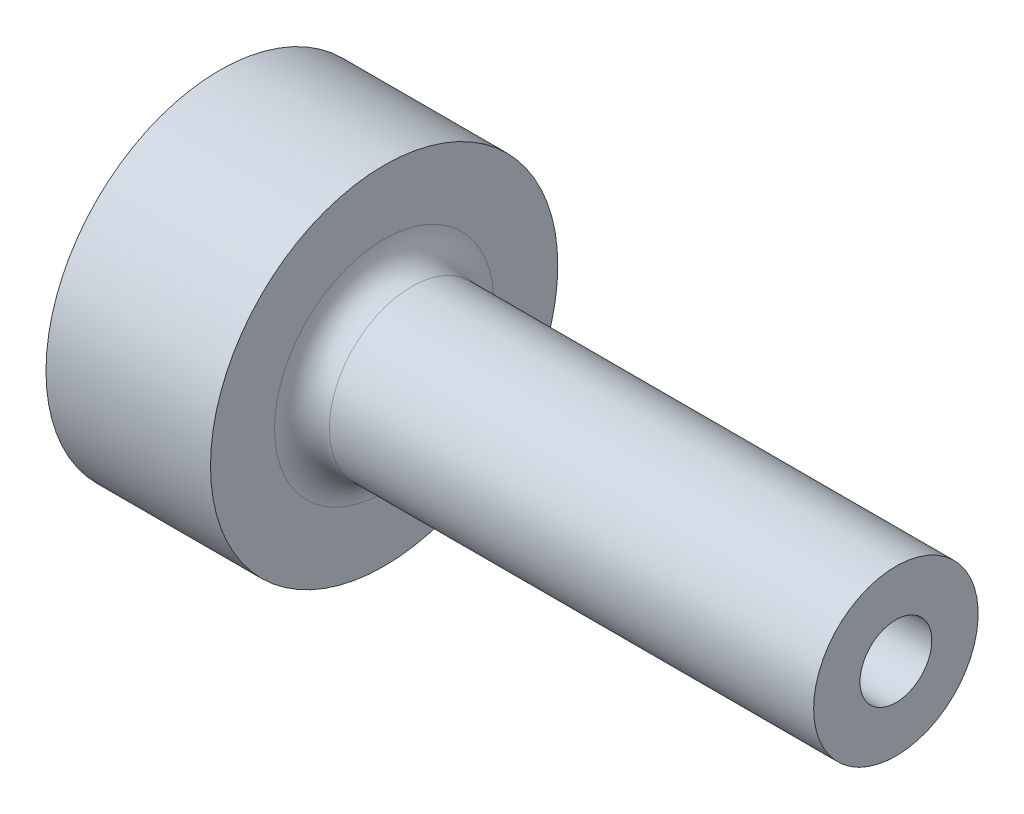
ISO-10303-21;
HEADER;
FILE_DESCRIPTION(('STEP AP214'),'2;1');
FILE_NAME('part.step','',(''),(''),'','','');
FILE_SCHEMA(('AUTOMOTIVE_DESIGN { 1 0 10303 214 1 1 1 1 }'));
ENDSEC;
DATA;
#1=APPLICATION_CONTEXT('core data for automotive mechanical design processes');
#2=APPLICATION_PROTOCOL_DEFINITION('international standard','automotive_design',2000,#1);
#3=PRODUCT_CONTEXT('',#1,'mechanical');
#4=PRODUCT('Part','Part','',(#3));
#5=PRODUCT_RELATED_PRODUCT_CATEGORY('part','',(#4));
#6=PRODUCT_DEFINITION_FORMATION('','',#4);
#7=PRODUCT_DEFINITION_CONTEXT('part definition',#1,'design');
#8=PRODUCT_DEFINITION('design','',#6,#7);
#9=PRODUCT_DEFINITION_SHAPE('','',#8);
#10=(LENGTH_UNIT() NAMED_UNIT(*) SI_UNIT(.MILLI.,.METRE.));
#11=(NAMED_UNIT(*) PLANE_ANGLE_UNIT() SI_UNIT($,.RADIAN.));
#12=(NAMED_UNIT(*) SI_UNIT($,.STERADIAN.) SOLID_ANGLE_UNIT());
#13=UNCERTAINTY_MEASURE_WITH_UNIT(LENGTH_MEASURE(1.E-05),#10,'distance_accuracy_value','');
#14=(GEOMETRIC_REPRESENTATION_CONTEXT(3) GLOBAL_UNCERTAINTY_ASSIGNED_CONTEXT((#13)) GLOBAL_UNIT_ASSIGNED_CONTEXT((#10,
#11,#12)) REPRESENTATION_CONTEXT('',''));
#15=CARTESIAN_POINT('',(0.,0.,0.));
#16=DIRECTION('',(0.,0.,1.));
#17=DIRECTION('',(1.,0.,0.));
#18=AXIS2_PLACEMENT_3D('',#15,#16,#17);
#19=CARTESIAN_POINT('',(0.,0.,0.));
#20=DIRECTION('',(-1.,0.,0.));
#21=DIRECTION('',(0.,0.,1.));
#22=AXIS2_PLACEMENT_3D('',#19,#20,#21);
#23=CYLINDRICAL_SURFACE('',#22,19.);
#24=CARTESIAN_POINT('',(18.,0.,0.));
#25=DIRECTION('',(-1.,0.,0.));
#26=DIRECTION('',(0.,0.,1.));
#27=AXIS2_PLACEMENT_3D('',#24,#25,#26);
#28=CIRCLE('',#27,19.);
#29=CARTESIAN_POINT('',(18.,0.,19.));
#30=VERTEX_POINT('',#29);
#31=EDGE_CURVE('E91',#30,#30,#28,.T.);
#32=ORIENTED_EDGE('',*,*,#31,.T.);
#33=EDGE_LOOP('',(#32));
#34=FACE_BOUND('',#33,.T.);
#35=CARTESIAN_POINT('',(0.,0.,0.));
#36=DIRECTION('',(-1.,0.,0.));
#37=DIRECTION('',(0.,0.,1.));
#38=AXIS2_PLACEMENT_3D('',#35,#36,#37);
#39=CIRCLE('',#38,19.);
#40=CARTESIAN_POINT('',(0.,0.,19.));
#41=VERTEX_POINT('',#40);
#42=EDGE_CURVE('E85',#41,#41,#39,.T.);
#43=ORIENTED_EDGE('',*,*,#42,.F.);
#44=EDGE_LOOP('',(#43));
#45=FACE_BOUND('',#44,.T.);
#46=CARTESIAN_POINT('',(11.,-19.,0.));
#47=CARTESIAN_POINT('',(10.9999951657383,-18.9999986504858,0.11200841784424));
#48=CARTESIAN_POINT('',(10.9905588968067,-18.9989990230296,0.224090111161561));
#49=CARTESIAN_POINT('',(10.953059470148,-18.9951074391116,0.445143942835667));
#50=CARTESIAN_POINT('',(10.9249759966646,-18.9922134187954,0.554112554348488));
#51=CARTESIAN_POINT('',(10.8510107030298,-18.9848596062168,0.765707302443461));
#52=CARTESIAN_POINT('',(10.8051398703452,-18.9804007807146,0.868337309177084));
#53=CARTESIAN_POINT('',(10.696923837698,-18.9704154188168,1.06441973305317));
#54=CARTESIAN_POINT('',(10.6345818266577,-18.9648890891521,1.15787392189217));
#55=CARTESIAN_POINT('',(10.494927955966,-18.9533628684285,1.33334438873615));
#56=CARTESIAN_POINT('',(10.417564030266,-18.9473613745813,1.41531912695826));
#57=CARTESIAN_POINT('',(10.2501736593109,-18.9355744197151,1.565146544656));
#58=CARTESIAN_POINT('',(10.1601466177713,-18.9297889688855,1.63299855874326));
#59=CARTESIAN_POINT('',(9.96972339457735,-18.9190729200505,1.75280323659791));
#60=CARTESIAN_POINT('',(9.86930325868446,-18.914144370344,1.80471802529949));
#61=CARTESIAN_POINT('',(9.66111022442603,-18.9057203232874,1.89093273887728));
#62=CARTESIAN_POINT('',(9.55333752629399,-18.90222478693,1.92523314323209));
#63=CARTESIAN_POINT('',(9.333924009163,-18.8970772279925,1.97512160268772));
#64=CARTESIAN_POINT('',(9.22229908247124,-18.89541839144,1.99077883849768));
#65=CARTESIAN_POINT('',(8.99799439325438,-18.8941109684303,2.0031504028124));
#66=CARTESIAN_POINT('',(8.88531466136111,-18.8944623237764,1.99986527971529));
#67=CARTESIAN_POINT('',(8.66257681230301,-18.8971293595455,1.97450235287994));
#68=CARTESIAN_POINT('',(8.55250997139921,-18.8994371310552,1.9525002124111));
#69=CARTESIAN_POINT('',(8.33763983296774,-18.9057446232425,1.89044560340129));
#70=CARTESIAN_POINT('',(8.23283661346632,-18.9097443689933,1.85039286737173));
#71=CARTESIAN_POINT('',(8.0312304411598,-18.9189942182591,1.75329092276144));
#72=CARTESIAN_POINT('',(7.93444370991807,-18.924246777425,1.69620827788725));
#73=CARTESIAN_POINT('',(7.75179548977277,-18.9354083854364,1.5666908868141));
#74=CARTESIAN_POINT('',(7.66593435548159,-18.9413174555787,1.49425564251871));
#75=CARTESIAN_POINT('',(7.50713503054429,-18.9531615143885,1.33566725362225));
#76=CARTESIAN_POINT('',(7.43426205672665,-18.9590964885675,1.24944878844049));
#77=CARTESIAN_POINT('',(7.30401357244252,-18.9702964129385,1.06596783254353));
#78=CARTESIAN_POINT('',(7.24663808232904,-18.9755613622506,0.968705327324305));
#79=CARTESIAN_POINT('',(7.14901535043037,-18.9848300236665,0.765851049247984));
#80=CARTESIAN_POINT('',(7.10877156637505,-18.9888334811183,0.660257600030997));
#81=CARTESIAN_POINT('',(7.04660317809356,-18.9951255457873,0.443760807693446));
#82=CARTESIAN_POINT('',(7.02467796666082,-18.9974142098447,0.332857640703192));
#83=CARTESIAN_POINT('',(6.9998521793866,-19.0000115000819,0.109454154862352));
#84=CARTESIAN_POINT('',(6.9968616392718,-19.0003294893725,-0.00303606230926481));
#85=CARTESIAN_POINT('',(7.00975357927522,-18.9989747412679,-0.226916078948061));
#86=CARTESIAN_POINT('',(7.02563577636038,-18.9973020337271,-0.338305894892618));
#87=CARTESIAN_POINT('',(7.07574769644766,-18.9921598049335,-0.556562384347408));
#88=CARTESIAN_POINT('',(7.10993514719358,-18.9886944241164,-0.663438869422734));
#89=CARTESIAN_POINT('',(7.1956435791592,-18.9803554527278,-0.869940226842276));
#90=CARTESIAN_POINT('',(7.24716498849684,-18.9754818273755,-0.969564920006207));
#91=CARTESIAN_POINT('',(7.36630089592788,-18.9648478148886,-1.1591405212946));
#92=CARTESIAN_POINT('',(7.43397432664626,-18.9590842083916,-1.2490542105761));
#93=CARTESIAN_POINT('',(7.58340899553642,-18.9473268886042,-1.4162783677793));
#94=CARTESIAN_POINT('',(7.665170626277,-18.9413331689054,-1.49358848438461));
#95=CARTESIAN_POINT('',(7.84085406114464,-18.9297628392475,-1.63372463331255));
#96=CARTESIAN_POINT('',(7.93482318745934,-18.9241879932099,-1.69649150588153));
#97=CARTESIAN_POINT('',(8.13202150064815,-18.9141138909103,-1.80535237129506));
#98=CARTESIAN_POINT('',(8.23525054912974,-18.9096146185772,-1.85144661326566));
#99=CARTESIAN_POINT('',(8.44783784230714,-18.9022123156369,-1.9255553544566));
#100=CARTESIAN_POINT('',(8.55718382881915,-18.8993062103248,-1.95360469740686));
#101=CARTESIAN_POINT('',(8.77906579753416,-18.8954098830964,-1.99094032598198));
#102=CARTESIAN_POINT('',(8.89160167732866,-18.8944195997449,-2.00022721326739));
#103=CARTESIAN_POINT('',(9.11608086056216,-18.8944684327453,-1.99976544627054));
#104=CARTESIAN_POINT('',(9.22802436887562,-18.8954976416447,-1.99010972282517));
#105=CARTESIAN_POINT('',(9.4486892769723,-18.8994483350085,-1.95223204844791));
#106=CARTESIAN_POINT('',(9.55741067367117,-18.9023698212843,-1.92401007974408));
#107=CARTESIAN_POINT('',(9.76854219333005,-18.9097730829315,-1.8498273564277));
#108=CARTESIAN_POINT('',(9.87095340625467,-18.914254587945,-1.80386967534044));
#109=CARTESIAN_POINT('',(10.0666237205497,-18.92427346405,-1.69552954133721));
#110=CARTESIAN_POINT('',(10.1598828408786,-18.9298108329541,-1.63314712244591));
#111=CARTESIAN_POINT('',(10.3350778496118,-18.9413500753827,-1.49337993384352));
#112=CARTESIAN_POINT('',(10.4169583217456,-18.9473540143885,-1.41592586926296));
#113=CARTESIAN_POINT('',(10.5665993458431,-18.9591311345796,-1.24835332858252));
#114=CARTESIAN_POINT('',(10.6343565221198,-18.9649042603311,-1.15823183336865));
#115=CARTESIAN_POINT('',(10.7539774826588,-18.975586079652,-0.967607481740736));
#116=CARTESIAN_POINT('',(10.8057969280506,-18.9804923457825,-0.867076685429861));
#117=CARTESIAN_POINT('',(10.8917493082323,-18.9888617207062,-0.658751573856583));
#118=CARTESIAN_POINT('',(10.9259020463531,-18.9923264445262,-0.550965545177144));
#119=CARTESIAN_POINT('',(10.9671005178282,-18.9965585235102,-0.368815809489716));
#120=CARTESIAN_POINT('',(10.9794208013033,-18.9978430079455,-0.295613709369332));
#121=CARTESIAN_POINT('',(10.9958721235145,-18.9995641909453,-0.148285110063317));
#122=CARTESIAN_POINT('',(11.0000032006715,-19.0000008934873,-0.0741586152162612));
#123=CARTESIAN_POINT('',(11.,-19.,0.));
#124=B_SPLINE_CURVE_WITH_KNOTS('',3,(#46,#47,#48,#49,#50,#51,#52,#53,#54,#55,#56,#57,#58,#59,
#60,#61,#62,#63,#64,#65,#66,#67,#68,#69,#70,#71,#72,#73,#74,#75,#76,#77,#78,#79,#80,#81,#82,#83,
#84,#85,#86,#87,#88,#89,#90,#91,#92,#93,#94,#95,#96,#97,#98,#99,#100,#101,#102,#103,#104,#105,
#106,#107,#108,#109,#110,#111,#112,#113,#114,#115,#116,#117,#118,#119,#120,#121,#122,#123),
.UNSPECIFIED.,.T.,.F.,(4,2,2,2,2,2,2,2,2,2,2,2,2,2,2,2,2,2,2,2,2,2,2,2,2,2,2,2,2,2,2,2,2,2,2,2,
2,2,4),(0.,0.335754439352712,0.671875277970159,1.00778882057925,1.34363737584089,
1.68067146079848,2.01772142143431,2.35556629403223,2.69340196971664,3.02998006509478,
3.36654841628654,3.7017626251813,4.03698180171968,4.37286352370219,4.70875614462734,
5.0462905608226,5.38382542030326,5.72142837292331,6.05902013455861,6.39500668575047,
6.73098819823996,7.06619715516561,7.40141439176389,7.73787392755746,8.07434284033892,
8.41215732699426,8.74996676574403,9.08712193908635,9.42426630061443,9.75976079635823,
10.095255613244,10.4306923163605,10.7661283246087,11.103144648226,11.4402414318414,
11.7782677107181,12.1159142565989,12.3382118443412,12.5605083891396),.UNSPECIFIED.);
#125=CARTESIAN_POINT('',(11.,-19.,0.));
#126=VERTEX_POINT('',#125);
#127=EDGE_CURVE('E10',#126,#126,#124,.T.);
#128=ORIENTED_EDGE('',*,*,#127,.F.);
#129=EDGE_LOOP('',(#128));
#130=FACE_BOUND('',#129,.T.);
#131=ADVANCED_FACE('F16',(#34,#45,#130),#23,.T.);
#132=CARTESIAN_POINT('',(0.,0.,0.));
#133=DIRECTION('',(1.,0.,0.));
#134=DIRECTION('',(0.,0.,-1.));
#135=AXIS2_PLACEMENT_3D('',#132,#133,#134);
#136=CONICAL_SURFACE('',#135,2.25,0.0226892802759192);
#137=CARTESIAN_POINT('',(74.,0.,0.));
#138=DIRECTION('',(-1.,0.,0.));
#139=DIRECTION('',(0.,0.,1.));
#140=AXIS2_PLACEMENT_3D('',#137,#138,#139);
#141=CIRCLE('',#140,3.92929491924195);
#142=CARTESIAN_POINT('',(74.,0.,3.92929491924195));
#143=VERTEX_POINT('',#142);
#144=EDGE_CURVE('E77',#143,#143,#141,.T.);
#145=ORIENTED_EDGE('',*,*,#144,.F.);
#146=EDGE_LOOP('',(#145));
#147=FACE_BOUND('',#146,.T.);
#148=CARTESIAN_POINT('',(3.81173528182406,0.,0.));
#149=DIRECTION('',(-1.,0.,0.));
#150=DIRECTION('',(0.,0.,1.));
#151=AXIS2_PLACEMENT_3D('',#148,#149,#150);
#152=CIRCLE('',#151,2.33650037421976);
#153=CARTESIAN_POINT('',(3.81173528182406,0.,2.33650037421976));
#154=VERTEX_POINT('',#153);
#155=EDGE_CURVE('E97',#154,#154,#152,.F.);
#156=ORIENTED_EDGE('',*,*,#155,.F.);
#157=EDGE_LOOP('',(#156));
#158=FACE_BOUND('',#157,.T.);
#159=ADVANCED_FACE('F44',(#147,#158),#136,.F.);
#160=CARTESIAN_POINT('',(21.,0.,0.));
#161=DIRECTION('',(-1.,0.,0.));
#162=DIRECTION('',(0.,0.,1.));
#163=AXIS2_PLACEMENT_3D('',#160,#161,#162);
#164=TOROIDAL_SURFACE('',#163,12.,3.);
#165=CARTESIAN_POINT('',(18.,0.,0.));
#166=DIRECTION('',(-1.,0.,0.));
#167=DIRECTION('',(0.,0.,1.));
#168=AXIS2_PLACEMENT_3D('',#165,#166,#167);
#169=CIRCLE('',#168,12.);
#170=CARTESIAN_POINT('',(18.,0.,12.));
#171=VERTEX_POINT('',#170);
#172=EDGE_CURVE('E93',#171,#171,#169,.T.);
#173=ORIENTED_EDGE('',*,*,#172,.F.);
#174=EDGE_LOOP('',(#173));
#175=FACE_BOUND('',#174,.T.);
#176=CARTESIAN_POINT('',(21.,0.,0.));
#177=DIRECTION('',(-1.,0.,0.));
#178=DIRECTION('',(0.,0.,1.));
#179=AXIS2_PLACEMENT_3D('',#176,#177,#178);
#180=CIRCLE('',#179,9.);
#181=CARTESIAN_POINT('',(21.,0.,9.));
#182=VERTEX_POINT('',#181);
#183=EDGE_CURVE('E29',#182,#182,#180,.T.);
#184=ORIENTED_EDGE('',*,*,#183,.T.);
#185=EDGE_LOOP('',(#184));
#186=FACE_BOUND('',#185,.T.);
#187=ADVANCED_FACE('F18',(#175,#186),#164,.F.);
#188=CARTESIAN_POINT('',(0.,0.,0.));
#189=DIRECTION('',(-1.,0.,0.));
#190=DIRECTION('',(0.,0.,1.));
#191=AXIS2_PLACEMENT_3D('',#188,#189,#190);
#192=CYLINDRICAL_SURFACE('',#191,9.);
#193=ORIENTED_EDGE('',*,*,#183,.F.);
#194=EDGE_LOOP('',(#193));
#195=FACE_BOUND('',#194,.T.);
#196=CARTESIAN_POINT('',(74.,0.,0.));
#197=DIRECTION('',(-1.,0.,0.));
#198=DIRECTION('',(0.,0.,1.));
#199=AXIS2_PLACEMENT_3D('',#196,#197,#198);
#200=CIRCLE('',#199,9.);
#201=CARTESIAN_POINT('',(74.,0.,9.));
#202=VERTEX_POINT('',#201);
#203=EDGE_CURVE('E75',#202,#202,#200,.T.);
#204=ORIENTED_EDGE('',*,*,#203,.T.);
#205=EDGE_LOOP('',(#204));
#206=FACE_BOUND('',#205,.T.);
#207=ADVANCED_FACE('F63',(#195,#206),#192,.T.);
#208=CARTESIAN_POINT('',(74.,9.,0.));
#209=DIRECTION('',(-1.,0.,0.));
#210=DIRECTION('',(0.,0.,1.));
#211=AXIS2_PLACEMENT_3D('',#208,#209,#210);
#212=PLANE('',#211);
#213=ORIENTED_EDGE('',*,*,#203,.F.);
#214=EDGE_LOOP('',(#213));
#215=FACE_BOUND('',#214,.T.);
#216=ORIENTED_EDGE('',*,*,#144,.T.);
#217=EDGE_LOOP('',(#216));
#218=FACE_BOUND('',#217,.T.);
#219=ADVANCED_FACE('F59',(#215,#218),#212,.F.);
#220=CARTESIAN_POINT('',(0.,2.25,0.));
#221=DIRECTION('',(1.,0.,0.));
#222=DIRECTION('',(0.,0.,-1.));
#223=AXIS2_PLACEMENT_3D('',#220,#221,#222);
#224=PLANE('',#223);
#225=CARTESIAN_POINT('',(0.,0.,0.));
#226=DIRECTION('',(-1.,0.,0.));
#227=DIRECTION('',(0.,0.,1.));
#228=AXIS2_PLACEMENT_3D('',#225,#226,#227);
#229=CIRCLE('',#228,15.5);
#230=CARTESIAN_POINT('',(0.,0.,15.5));
#231=VERTEX_POINT('',#230);
#232=EDGE_CURVE('E101',#231,#231,#229,.T.);
#233=ORIENTED_EDGE('',*,*,#232,.F.);
#234=EDGE_LOOP('',(#233));
#235=FACE_BOUND('',#234,.T.);
#236=ORIENTED_EDGE('',*,*,#42,.T.);
#237=EDGE_LOOP('',(#236));
#238=FACE_BOUND('',#237,.T.);
#239=ADVANCED_FACE('F57',(#235,#238),#224,.F.);
#240=CARTESIAN_POINT('',(18.,19.,0.));
#241=DIRECTION('',(-1.,0.,0.));
#242=DIRECTION('',(0.,0.,1.));
#243=AXIS2_PLACEMENT_3D('',#240,#241,#242);
#244=PLANE('',#243);
#245=ORIENTED_EDGE('',*,*,#31,.F.);
#246=EDGE_LOOP('',(#245));
#247=FACE_BOUND('',#246,.T.);
#248=ORIENTED_EDGE('',*,*,#172,.T.);
#249=EDGE_LOOP('',(#248));
#250=FACE_BOUND('',#249,.T.);
#251=ADVANCED_FACE('F55',(#247,#250),#244,.F.);
#252=CARTESIAN_POINT('',(-35.9477938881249,0.,0.));
#253=DIRECTION('',(-1.,0.,0.));
#254=DIRECTION('',(0.,0.,1.));
#255=AXIS2_PLACEMENT_3D('',#252,#253,#254);
#256=DEGENERATE_TOROIDAL_SURFACE('',#255,2.0429790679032,40.,.F.);
#257=ORIENTED_EDGE('',*,*,#232,.T.);
#258=EDGE_LOOP('',(#257));
#259=FACE_BOUND('',#258,.T.);
#260=ORIENTED_EDGE('',*,*,#155,.T.);
#261=EDGE_LOOP('',(#260));
#262=FACE_BOUND('',#261,.T.);
#263=ADVANCED_FACE('F40',(#259,#262),#256,.T.);
#264=CARTESIAN_POINT('',(9.,-19.,0.));
#265=DIRECTION('',(0.,-1.,0.));
#266=DIRECTION('',(1.,0.,0.));
#267=AXIS2_PLACEMENT_3D('',#264,#265,#266);
#268=CYLINDRICAL_SURFACE('',#267,2.);
#269=CARTESIAN_POINT('',(9.,-13.,0.));
#270=DIRECTION('',(0.,-1.,0.));
#271=DIRECTION('',(1.,0.,0.));
#272=AXIS2_PLACEMENT_3D('',#269,#270,#271);
#273=CIRCLE('',#272,2.);
#274=CARTESIAN_POINT('',(11.,-13.,0.));
#275=VERTEX_POINT('',#274);
#276=EDGE_CURVE('E104',#275,#275,#273,.T.);
#277=ORIENTED_EDGE('',*,*,#276,.F.);
#278=EDGE_LOOP('',(#277));
#279=FACE_BOUND('',#278,.T.);
#280=ORIENTED_EDGE('',*,*,#127,.T.);
#281=EDGE_LOOP('',(#280));
#282=FACE_BOUND('',#281,.T.);
#283=ADVANCED_FACE('F34',(#279,#282),#268,.F.);
#284=CARTESIAN_POINT('',(9.,-11.8452994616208,0.));
#285=DIRECTION('',(0.,-1.,0.));
#286=DIRECTION('',(1.,0.,0.));
#287=AXIS2_PLACEMENT_3D('',#284,#285,#286);
#288=CONICAL_SURFACE('',#287,0.,1.0471975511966);
#289=ORIENTED_EDGE('',*,*,#276,.T.);
#290=EDGE_LOOP('',(#289));
#291=FACE_BOUND('',#290,.T.);
#292=CARTESIAN_POINT('',(9.,-11.8452994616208,0.));
#293=VERTEX_POINT('',#292);
#294=VERTEX_LOOP('',#293);
#295=FACE_BOUND('',#294,.T.);
#296=ADVANCED_FACE('F32',(#291,#295),#288,.F.);
#297=CLOSED_SHELL('',(#131,#159,#187,#207,#219,#239,#251,#263,#283,#296));
#298=MANIFOLD_SOLID_BREP('B1',#297);
#299=ADVANCED_BREP_SHAPE_REPRESENTATION('',(#18,#298),#14);
#300=SHAPE_DEFINITION_REPRESENTATION(#9,#299);
ENDSEC;
END-ISO-10303-21;
